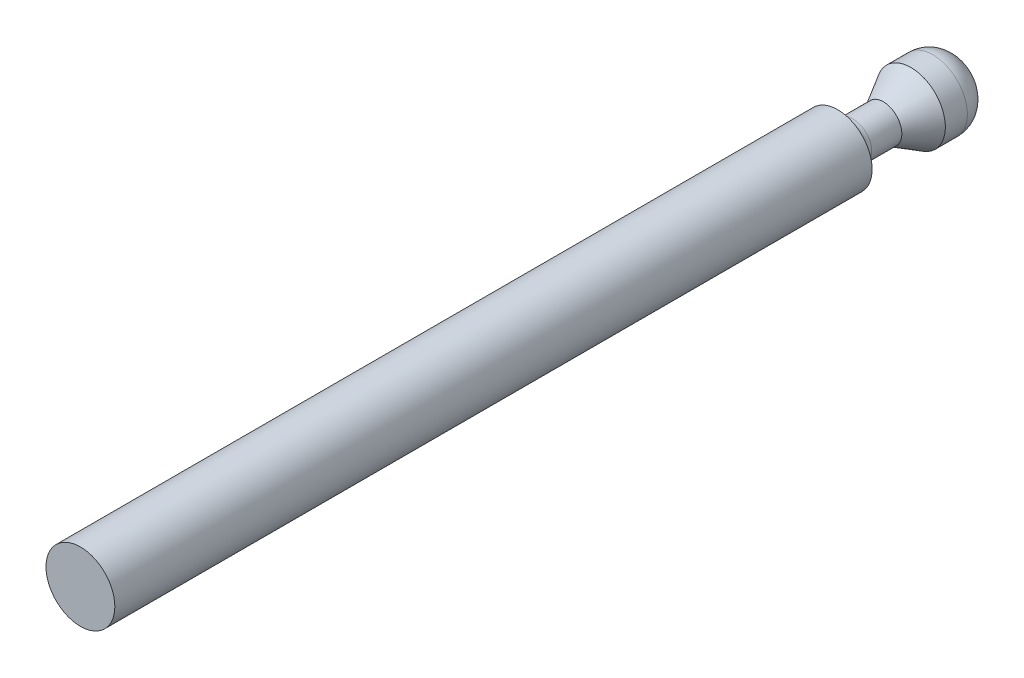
ISO-10303-21;
HEADER;
FILE_DESCRIPTION(('STEP AP214'),'2;1');
FILE_NAME('part.step','',(''),(''),'','','');
FILE_SCHEMA(('AUTOMOTIVE_DESIGN { 1 0 10303 214 1 1 1 1 }'));
ENDSEC;
DATA;
#1=APPLICATION_CONTEXT('core data for automotive mechanical design processes');
#2=APPLICATION_PROTOCOL_DEFINITION('international standard','automotive_design',2000,#1);
#3=PRODUCT_CONTEXT('',#1,'mechanical');
#4=PRODUCT('Part','Part','',(#3));
#5=PRODUCT_RELATED_PRODUCT_CATEGORY('part','',(#4));
#6=PRODUCT_DEFINITION_FORMATION('','',#4);
#7=PRODUCT_DEFINITION_CONTEXT('part definition',#1,'design');
#8=PRODUCT_DEFINITION('design','',#6,#7);
#9=PRODUCT_DEFINITION_SHAPE('','',#8);
#10=(LENGTH_UNIT() NAMED_UNIT(*) SI_UNIT(.MILLI.,.METRE.));
#11=(NAMED_UNIT(*) PLANE_ANGLE_UNIT() SI_UNIT($,.RADIAN.));
#12=(NAMED_UNIT(*) SI_UNIT($,.STERADIAN.) SOLID_ANGLE_UNIT());
#13=UNCERTAINTY_MEASURE_WITH_UNIT(LENGTH_MEASURE(1.E-05),#10,'distance_accuracy_value','');
#14=(GEOMETRIC_REPRESENTATION_CONTEXT(3) GLOBAL_UNCERTAINTY_ASSIGNED_CONTEXT((#13)) GLOBAL_UNIT_ASSIGNED_CONTEXT((#10,
#11,#12)) REPRESENTATION_CONTEXT('',''));
#15=CARTESIAN_POINT('',(0.,0.,0.));
#16=DIRECTION('',(0.,0.,1.));
#17=DIRECTION('',(1.,0.,0.));
#18=AXIS2_PLACEMENT_3D('',#15,#16,#17);
#19=CARTESIAN_POINT('',(0.,0.,-99.));
#20=DIRECTION('',(0.,0.,-1.));
#21=DIRECTION('',(0.5,-0.866025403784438,0.));
#22=AXIS2_PLACEMENT_3D('',#19,#20,#21);
#23=CONICAL_SURFACE('',#22,1.,1.02974425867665);
#24=CARTESIAN_POINT('',(0.,0.,-98.3991393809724));
#25=VERTEX_POINT('',#24);
#26=VERTEX_LOOP('',#25);
#27=FACE_BOUND('',#26,.T.);
#28=CARTESIAN_POINT('',(0.,0.,-99.));
#29=DIRECTION('',(0.,0.,-1.));
#30=DIRECTION('',(0.5,-0.866025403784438,0.));
#31=AXIS2_PLACEMENT_3D('',#28,#29,#30);
#32=CIRCLE('',#31,1.);
#33=CARTESIAN_POINT('',(0.5,-0.866025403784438,-99.));
#34=VERTEX_POINT('',#33);
#35=EDGE_CURVE('E31',#34,#34,#32,.T.);
#36=ORIENTED_EDGE('',*,*,#35,.T.);
#37=EDGE_LOOP('',(#36));
#38=FACE_BOUND('',#37,.T.);
#39=ADVANCED_FACE('F14',(#27,#38),#23,.F.);
#40=CARTESIAN_POINT('',(0.,0.,-102.));
#41=DIRECTION('',(0.,0.,-1.));
#42=DIRECTION('',(0.5,-0.866025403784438,0.));
#43=AXIS2_PLACEMENT_3D('',#40,#41,#42);
#44=CYLINDRICAL_SURFACE('',#43,1.);
#45=ORIENTED_EDGE('',*,*,#35,.F.);
#46=EDGE_LOOP('',(#45));
#47=FACE_BOUND('',#46,.T.);
#48=CARTESIAN_POINT('',(0.,0.,-100.960769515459));
#49=DIRECTION('',(0.,0.,-1.));
#50=DIRECTION('',(0.5,-0.866025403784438,0.));
#51=AXIS2_PLACEMENT_3D('',#48,#49,#50);
#52=CIRCLE('',#51,1.);
#53=CARTESIAN_POINT('',(0.5,-0.866025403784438,-100.960769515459));
#54=VERTEX_POINT('',#53);
#55=EDGE_CURVE('E33',#54,#54,#52,.T.);
#56=ORIENTED_EDGE('',*,*,#55,.T.);
#57=EDGE_LOOP('',(#56));
#58=FACE_BOUND('',#57,.T.);
#59=ADVANCED_FACE('F26',(#47,#58),#44,.F.);
#60=CARTESIAN_POINT('',(0.,0.,-102.));
#61=DIRECTION('',(0.,0.,-1.));
#62=DIRECTION('',(0.5,-0.866025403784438,0.));
#63=AXIS2_PLACEMENT_3D('',#60,#61,#62);
#64=CONICAL_SURFACE('',#63,1.6,0.523598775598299);
#65=ORIENTED_EDGE('',*,*,#55,.F.);
#66=EDGE_LOOP('',(#65));
#67=FACE_BOUND('',#66,.T.);
#68=CARTESIAN_POINT('',(0.,0.,-102.));
#69=DIRECTION('',(0.,0.,-1.));
#70=DIRECTION('',(0.5,-0.866025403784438,0.));
#71=AXIS2_PLACEMENT_3D('',#68,#69,#70);
#72=CIRCLE('',#71,1.6);
#73=CARTESIAN_POINT('',(0.8,-1.3856406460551,-102.));
#74=VERTEX_POINT('',#73);
#75=EDGE_CURVE('E37',#74,#74,#72,.T.);
#76=ORIENTED_EDGE('',*,*,#75,.T.);
#77=EDGE_LOOP('',(#76));
#78=FACE_BOUND('',#77,.T.);
#79=ADVANCED_FACE('F88',(#67,#78),#64,.F.);
#80=CARTESIAN_POINT('',(0.,0.,-99.0606123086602));
#81=DIRECTION('',(0.,0.,-1.));
#82=DIRECTION('',(0.5,-0.866025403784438,0.));
#83=AXIS2_PLACEMENT_3D('',#80,#81,#82);
#84=DEGENERATE_TOROIDAL_SURFACE('',#83,1.,3.,.T.);
#85=CARTESIAN_POINT('',(0.,0.,-99.0606123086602));
#86=DIRECTION('',(0.,0.,-1.));
#87=DIRECTION('',(0.5,-0.866025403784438,0.));
#88=AXIS2_PLACEMENT_3D('',#85,#86,#87);
#89=CIRCLE('',#88,4.);
#90=CARTESIAN_POINT('',(2.,-3.46410161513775,-99.0606123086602));
#91=VERTEX_POINT('',#90);
#92=EDGE_CURVE('E9',#91,#91,#89,.F.);
#93=ORIENTED_EDGE('',*,*,#92,.F.);
#94=EDGE_LOOP('',(#93));
#95=FACE_BOUND('',#94,.T.);
#96=ORIENTED_EDGE('',*,*,#75,.F.);
#97=EDGE_LOOP('',(#96));
#98=FACE_BOUND('',#97,.T.);
#99=ADVANCED_FACE('F16',(#95,#98),#84,.T.);
#100=CARTESIAN_POINT('',(0.,0.,-46.5));
#101=DIRECTION('',(0.,0.,-1.));
#102=DIRECTION('',(0.5,-0.866025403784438,0.));
#103=AXIS2_PLACEMENT_3D('',#100,#101,#102);
#104=CYLINDRICAL_SURFACE('',#103,4.);
#105=ORIENTED_EDGE('',*,*,#92,.T.);
#106=EDGE_LOOP('',(#105));
#107=FACE_BOUND('',#106,.T.);
#108=CARTESIAN_POINT('',(0.,0.,-96.5042939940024));
#109=DIRECTION('',(0.,0.,-1.));
#110=DIRECTION('',(0.5,-0.866025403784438,0.));
#111=AXIS2_PLACEMENT_3D('',#108,#109,#110);
#112=CIRCLE('',#111,4.);
#113=CARTESIAN_POINT('',(2.,-3.46410161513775,-96.5042939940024));
#114=VERTEX_POINT('',#113);
#115=EDGE_CURVE('E47',#114,#114,#112,.T.);
#116=ORIENTED_EDGE('',*,*,#115,.T.);
#117=EDGE_LOOP('',(#116));
#118=FACE_BOUND('',#117,.T.);
#119=ADVANCED_FACE('F75',(#107,#118),#104,.T.);
#120=CARTESIAN_POINT('',(0.,0.,-96.5042939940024));
#121=DIRECTION('',(0.,0.,-1.));
#122=DIRECTION('',(0.5,-0.866025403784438,0.));
#123=AXIS2_PLACEMENT_3D('',#120,#121,#122);
#124=CONICAL_SURFACE('',#123,4.,0.523598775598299);
#125=CARTESIAN_POINT('',(0.,0.,-93.3));
#126=DIRECTION('',(0.,0.,-1.));
#127=DIRECTION('',(0.5,-0.866025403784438,0.));
#128=AXIS2_PLACEMENT_3D('',#125,#126,#127);
#129=CIRCLE('',#128,2.15);
#130=CARTESIAN_POINT('',(1.075,-1.86195461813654,-93.3));
#131=VERTEX_POINT('',#130);
#132=EDGE_CURVE('E50',#131,#131,#129,.T.);
#133=ORIENTED_EDGE('',*,*,#132,.T.);
#134=EDGE_LOOP('',(#133));
#135=FACE_BOUND('',#134,.T.);
#136=ORIENTED_EDGE('',*,*,#115,.F.);
#137=EDGE_LOOP('',(#136));
#138=FACE_BOUND('',#137,.T.);
#139=ADVANCED_FACE('F68',(#135,#138),#124,.T.);
#140=CARTESIAN_POINT('',(0.,0.,-46.5));
#141=DIRECTION('',(0.,0.,-1.));
#142=DIRECTION('',(0.5,-0.866025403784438,0.));
#143=AXIS2_PLACEMENT_3D('',#140,#141,#142);
#144=CYLINDRICAL_SURFACE('',#143,2.15);
#145=CARTESIAN_POINT('',(0.,0.,-89.8));
#146=DIRECTION('',(0.,0.,-1.));
#147=DIRECTION('',(0.5,-0.866025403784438,0.));
#148=AXIS2_PLACEMENT_3D('',#145,#146,#147);
#149=CIRCLE('',#148,2.15);
#150=CARTESIAN_POINT('',(1.075,-1.86195461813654,-89.8));
#151=VERTEX_POINT('',#150);
#152=EDGE_CURVE('E53',#151,#151,#149,.T.);
#153=ORIENTED_EDGE('',*,*,#152,.T.);
#154=EDGE_LOOP('',(#153));
#155=FACE_BOUND('',#154,.T.);
#156=ORIENTED_EDGE('',*,*,#132,.F.);
#157=EDGE_LOOP('',(#156));
#158=FACE_BOUND('',#157,.T.);
#159=ADVANCED_FACE('F63',(#155,#158),#144,.T.);
#160=CARTESIAN_POINT('',(0.,0.,-89.8));
#161=DIRECTION('',(0.,0.,-1.));
#162=DIRECTION('',(0.5,-0.866025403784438,0.));
#163=AXIS2_PLACEMENT_3D('',#160,#161,#162);
#164=TOROIDAL_SURFACE('',#163,3.95,1.8);
#165=CARTESIAN_POINT('',(0.,0.,-88.));
#166=DIRECTION('',(0.,0.,-1.));
#167=DIRECTION('',(0.5,-0.866025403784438,0.));
#168=AXIS2_PLACEMENT_3D('',#165,#166,#167);
#169=CIRCLE('',#168,3.95);
#170=CARTESIAN_POINT('',(1.975,-3.42080034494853,-88.));
#171=VERTEX_POINT('',#170);
#172=EDGE_CURVE('E21',#171,#171,#169,.F.);
#173=ORIENTED_EDGE('',*,*,#172,.F.);
#174=EDGE_LOOP('',(#173));
#175=FACE_BOUND('',#174,.T.);
#176=ORIENTED_EDGE('',*,*,#152,.F.);
#177=EDGE_LOOP('',(#176));
#178=FACE_BOUND('',#177,.T.);
#179=ADVANCED_FACE('F28',(#175,#178),#164,.F.);
#180=CARTESIAN_POINT('',(-3.46410161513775,-2.,-88.));
#181=DIRECTION('',(0.,0.,-1.));
#182=DIRECTION('',(0.5,-0.866025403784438,0.));
#183=AXIS2_PLACEMENT_3D('',#180,#181,#182);
#184=PLANE('',#183);
#185=ORIENTED_EDGE('',*,*,#172,.T.);
#186=EDGE_LOOP('',(#185));
#187=FACE_BOUND('',#186,.T.);
#188=CARTESIAN_POINT('',(0.,0.,-88.));
#189=DIRECTION('',(0.,0.,-1.));
#190=DIRECTION('',(0.5,-0.866025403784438,0.));
#191=AXIS2_PLACEMENT_3D('',#188,#189,#190);
#192=CIRCLE('',#191,4.);
#193=CARTESIAN_POINT('',(2.,-3.46410161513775,-88.));
#194=VERTEX_POINT('',#193);
#195=EDGE_CURVE('E44',#194,#194,#192,.T.);
#196=ORIENTED_EDGE('',*,*,#195,.T.);
#197=EDGE_LOOP('',(#196));
#198=FACE_BOUND('',#197,.T.);
#199=ADVANCED_FACE('F58',(#187,#198),#184,.T.);
#200=CARTESIAN_POINT('',(0.,0.,-46.5));
#201=DIRECTION('',(0.,0.,-1.));
#202=DIRECTION('',(0.5,-0.866025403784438,0.));
#203=AXIS2_PLACEMENT_3D('',#200,#201,#202);
#204=CYLINDRICAL_SURFACE('',#203,4.);
#205=ORIENTED_EDGE('',*,*,#195,.F.);
#206=EDGE_LOOP('',(#205));
#207=FACE_BOUND('',#206,.T.);
#208=CARTESIAN_POINT('',(0.,0.,0.));
#209=DIRECTION('',(0.,0.,1.));
#210=DIRECTION('',(1.,0.,0.));
#211=AXIS2_PLACEMENT_3D('',#208,#209,#210);
#212=CIRCLE('',#211,4.);
#213=CARTESIAN_POINT('',(4.,0.,0.));
#214=VERTEX_POINT('',#213);
#215=EDGE_CURVE('E34',#214,#214,#212,.T.);
#216=ORIENTED_EDGE('',*,*,#215,.F.);
#217=EDGE_LOOP('',(#216));
#218=FACE_BOUND('',#217,.T.);
#219=ADVANCED_FACE('F82',(#207,#218),#204,.T.);
#220=CARTESIAN_POINT('',(0.,0.,0.));
#221=DIRECTION('',(0.,0.,1.));
#222=DIRECTION('',(1.,0.,0.));
#223=AXIS2_PLACEMENT_3D('',#220,#221,#222);
#224=PLANE('',#223);
#225=ORIENTED_EDGE('',*,*,#215,.T.);
#226=EDGE_LOOP('',(#225));
#227=FACE_BOUND('',#226,.T.);
#228=ADVANCED_FACE('F70',(#227),#224,.T.);
#229=CLOSED_SHELL('',(#39,#59,#79,#99,#119,#139,#159,#179,#199,#219,#228));
#230=MANIFOLD_SOLID_BREP('B1',#229);
#231=ADVANCED_BREP_SHAPE_REPRESENTATION('',(#18,#230),#14);
#232=SHAPE_DEFINITION_REPRESENTATION(#9,#231);
ENDSEC;
END-ISO-10303-21;
